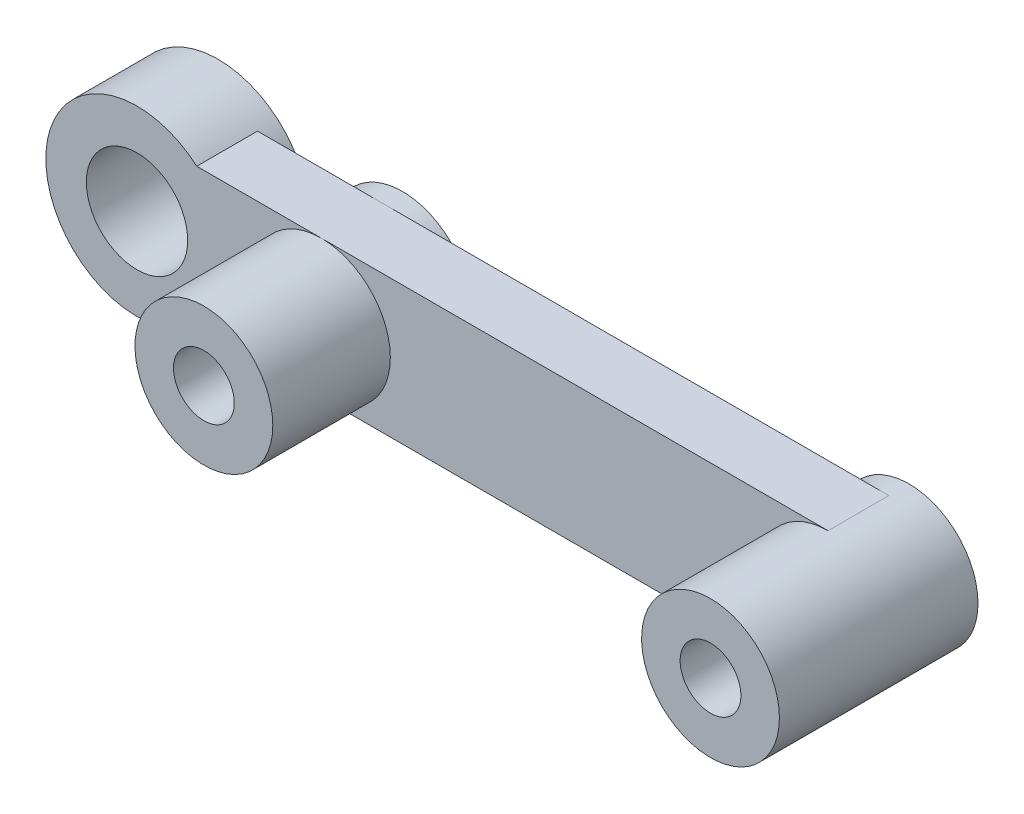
ISO-10303-21;
HEADER;
FILE_DESCRIPTION(('STEP AP214'),'2;1');
FILE_NAME('part.step','',(''),(''),'','','');
FILE_SCHEMA(('AUTOMOTIVE_DESIGN { 1 0 10303 214 1 1 1 1 }'));
ENDSEC;
DATA;
#1=APPLICATION_CONTEXT('core data for automotive mechanical design processes');
#2=APPLICATION_PROTOCOL_DEFINITION('international standard','automotive_design',2000,#1);
#3=PRODUCT_CONTEXT('',#1,'mechanical');
#4=PRODUCT('Part','Part','',(#3));
#5=PRODUCT_RELATED_PRODUCT_CATEGORY('part','',(#4));
#6=PRODUCT_DEFINITION_FORMATION('','',#4);
#7=PRODUCT_DEFINITION_CONTEXT('part definition',#1,'design');
#8=PRODUCT_DEFINITION('design','',#6,#7);
#9=PRODUCT_DEFINITION_SHAPE('','',#8);
#10=(LENGTH_UNIT() NAMED_UNIT(*) SI_UNIT(.MILLI.,.METRE.));
#11=(NAMED_UNIT(*) PLANE_ANGLE_UNIT() SI_UNIT($,.RADIAN.));
#12=(NAMED_UNIT(*) SI_UNIT($,.STERADIAN.) SOLID_ANGLE_UNIT());
#13=UNCERTAINTY_MEASURE_WITH_UNIT(LENGTH_MEASURE(1.E-05),#10,'distance_accuracy_value','');
#14=(GEOMETRIC_REPRESENTATION_CONTEXT(3) GLOBAL_UNCERTAINTY_ASSIGNED_CONTEXT((#13)) GLOBAL_UNIT_ASSIGNED_CONTEXT((#10,
#11,#12)) REPRESENTATION_CONTEXT('',''));
#15=CARTESIAN_POINT('',(0.,0.,0.));
#16=DIRECTION('',(0.,0.,1.));
#17=DIRECTION('',(1.,0.,0.));
#18=AXIS2_PLACEMENT_3D('',#15,#16,#17);
#19=CARTESIAN_POINT('',(-18.1747720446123,0.,0.));
#20=DIRECTION('',(0.,0.,1.));
#21=DIRECTION('',(1.,0.,0.));
#22=AXIS2_PLACEMENT_3D('',#19,#20,#21);
#23=PLANE('',#22);
#24=DIRECTION('',(1.,0.,0.));
#25=VECTOR('',#24,1.);
#26=CARTESIAN_POINT('',(-18.1747720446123,1.,0.));
#27=LINE('',#26,#25);
#28=CARTESIAN_POINT('',(-13.7872898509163,1.,0.));
#29=VERTEX_POINT('',#28);
#30=CARTESIAN_POINT('',(-12.3243874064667,1.,0.));
#31=VERTEX_POINT('',#30);
#32=EDGE_CURVE('E474',#29,#31,#27,.T.);
#33=ORIENTED_EDGE('',*,*,#32,.F.);
#34=CARTESIAN_POINT('',(-18.1747720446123,0.,0.));
#35=DIRECTION('',(0.,0.,1.));
#36=DIRECTION('',(1.,0.,0.));
#37=AXIS2_PLACEMENT_3D('',#34,#35,#36);
#38=CIRCLE('',#37,4.5);
#39=CARTESIAN_POINT('',(-15.2268914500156,3.4,0.));
#40=VERTEX_POINT('',#39);
#41=EDGE_CURVE('E472',#40,#29,#38,.F.);
#42=ORIENTED_EDGE('',*,*,#41,.F.);
#43=DIRECTION('',(-1.,0.,0.));
#44=VECTOR('',#43,1.);
#45=CARTESIAN_POINT('',(-15.2268914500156,3.4,0.));
#46=LINE('',#45,#44);
#47=CARTESIAN_POINT('',(-9.07477204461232,3.4,0.));
#48=VERTEX_POINT('',#47);
#49=EDGE_CURVE('E513',#48,#40,#46,.T.);
#50=ORIENTED_EDGE('',*,*,#49,.F.);
#51=CARTESIAN_POINT('',(-9.07477204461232,0.,0.));
#52=DIRECTION('',(0.,0.,1.));
#53=DIRECTION('',(1.,0.,0.));
#54=AXIS2_PLACEMENT_3D('',#51,#52,#53);
#55=CIRCLE('',#54,3.4);
#56=EDGE_CURVE('E497',#31,#48,#55,.F.);
#57=ORIENTED_EDGE('',*,*,#56,.F.);
#58=EDGE_LOOP('',(#33,#42,#50,#57));
#59=FACE_BOUND('',#58,.T.);
#60=ADVANCED_FACE('F350',(#59),#23,.F.);
#61=DIRECTION('',(1.,0.,0.));
#62=VECTOR('',#61,1.);
#63=CARTESIAN_POINT('',(-18.1747720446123,1.,0.));
#64=LINE('',#63,#62);
#65=CARTESIAN_POINT('',(-5.82515668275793,1.,0.));
#66=VERTEX_POINT('',#65);
#67=CARTESIAN_POINT('',(12.6756125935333,1.,0.));
#68=VERTEX_POINT('',#67);
#69=EDGE_CURVE('E598',#66,#68,#64,.T.);
#70=ORIENTED_EDGE('',*,*,#69,.F.);
#71=EDGE_CURVE('E494',#48,#66,#55,.F.);
#72=ORIENTED_EDGE('',*,*,#71,.F.);
#73=CARTESIAN_POINT('',(15.9252279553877,3.4,0.));
#74=VERTEX_POINT('',#73);
#75=EDGE_CURVE('E514',#74,#48,#46,.T.);
#76=ORIENTED_EDGE('',*,*,#75,.F.);
#77=CARTESIAN_POINT('',(15.9252279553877,0.,0.));
#78=DIRECTION('',(0.,0.,1.));
#79=DIRECTION('',(1.,0.,0.));
#80=AXIS2_PLACEMENT_3D('',#77,#78,#79);
#81=CIRCLE('',#80,3.4);
#82=EDGE_CURVE('E538',#68,#74,#81,.F.);
#83=ORIENTED_EDGE('',*,*,#82,.F.);
#84=EDGE_LOOP('',(#70,#72,#76,#83));
#85=FACE_BOUND('',#84,.T.);
#86=ADVANCED_FACE('F648',(#85),#23,.F.);
#87=CARTESIAN_POINT('',(-9.07477204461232,0.,8.8));
#88=DIRECTION('',(0.,0.,-1.));
#89=DIRECTION('',(-1.,0.,0.));
#90=AXIS2_PLACEMENT_3D('',#87,#88,#89);
#91=CYLINDRICAL_SURFACE('',#90,3.4);
#92=DIRECTION('',(0.,0.,-1.));
#93=VECTOR('',#92,1.);
#94=CARTESIAN_POINT('',(-12.3243874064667,1.,8.8));
#95=LINE('',#94,#93);
#96=CARTESIAN_POINT('',(-12.3243874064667,1.,-1.));
#97=VERTEX_POINT('',#96);
#98=EDGE_CURVE('E458',#31,#97,#95,.T.);
#99=ORIENTED_EDGE('',*,*,#98,.F.);
#100=ORIENTED_EDGE('',*,*,#56,.T.);
#101=ORIENTED_EDGE('',*,*,#71,.T.);
#102=DIRECTION('',(0.,0.,-1.));
#103=VECTOR('',#102,1.);
#104=CARTESIAN_POINT('',(-5.82515668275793,1.,8.8));
#105=LINE('',#104,#103);
#106=CARTESIAN_POINT('',(-5.82515668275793,1.,-1.));
#107=VERTEX_POINT('',#106);
#108=EDGE_CURVE('E582',#107,#66,#105,.F.);
#109=ORIENTED_EDGE('',*,*,#108,.F.);
#110=CARTESIAN_POINT('',(-9.07477204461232,0.,-1.));
#111=DIRECTION('',(0.,0.,1.));
#112=DIRECTION('',(1.,0.,0.));
#113=AXIS2_PLACEMENT_3D('',#110,#111,#112);
#114=CIRCLE('',#113,3.4);
#115=EDGE_CURVE('E488',#107,#97,#114,.T.);
#116=ORIENTED_EDGE('',*,*,#115,.T.);
#117=EDGE_LOOP('',(#99,#100,#101,#109,#116));
#118=FACE_BOUND('',#117,.T.);
#119=ADVANCED_FACE('F642',(#118),#91,.T.);
#120=CARTESIAN_POINT('',(-18.1747720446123,0.,3.));
#121=DIRECTION('',(0.,0.,1.));
#122=DIRECTION('',(1.,0.,0.));
#123=AXIS2_PLACEMENT_3D('',#120,#121,#122);
#124=PLANE('',#123);
#125=CARTESIAN_POINT('',(-18.1747720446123,0.,3.));
#126=DIRECTION('',(0.,0.,1.));
#127=DIRECTION('',(1.,0.,0.));
#128=AXIS2_PLACEMENT_3D('',#125,#126,#127);
#129=CIRCLE('',#128,2.5);
#130=CARTESIAN_POINT('',(-15.6747720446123,0.,3.));
#131=VERTEX_POINT('',#130);
#132=EDGE_CURVE('E572',#131,#131,#129,.T.);
#133=ORIENTED_EDGE('',*,*,#132,.F.);
#134=EDGE_LOOP('',(#133));
#135=FACE_BOUND('',#134,.T.);
#136=CARTESIAN_POINT('',(-18.1747720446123,0.,3.));
#137=DIRECTION('',(0.,0.,1.));
#138=DIRECTION('',(1.,0.,0.));
#139=AXIS2_PLACEMENT_3D('',#136,#137,#138);
#140=CIRCLE('',#139,4.5);
#141=CARTESIAN_POINT('',(-15.2268914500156,3.4,3.));
#142=VERTEX_POINT('',#141);
#143=CARTESIAN_POINT('',(-15.2268914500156,-3.4,3.));
#144=VERTEX_POINT('',#143);
#145=EDGE_CURVE('E517',#142,#144,#140,.T.);
#146=ORIENTED_EDGE('',*,*,#145,.T.);
#147=DIRECTION('',(1.,0.,0.));
#148=VECTOR('',#147,1.);
#149=CARTESIAN_POINT('',(-15.2268914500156,-3.4,3.));
#150=LINE('',#149,#148);
#151=CARTESIAN_POINT('',(-9.07477204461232,-3.4,3.));
#152=VERTEX_POINT('',#151);
#153=EDGE_CURVE('E520',#144,#152,#150,.T.);
#154=ORIENTED_EDGE('',*,*,#153,.T.);
#155=CARTESIAN_POINT('',(-9.07477204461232,0.,3.));
#156=DIRECTION('',(0.,0.,1.));
#157=DIRECTION('',(1.,0.,0.));
#158=AXIS2_PLACEMENT_3D('',#155,#156,#157);
#159=CIRCLE('',#158,3.4);
#160=CARTESIAN_POINT('',(-9.07477204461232,3.4,3.));
#161=VERTEX_POINT('',#160);
#162=EDGE_CURVE('E501',#152,#161,#159,.F.);
#163=ORIENTED_EDGE('',*,*,#162,.T.);
#164=DIRECTION('',(-1.,0.,0.));
#165=VECTOR('',#164,1.);
#166=CARTESIAN_POINT('',(-15.2268914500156,3.4,3.));
#167=LINE('',#166,#165);
#168=EDGE_CURVE('E523',#161,#142,#167,.T.);
#169=ORIENTED_EDGE('',*,*,#168,.T.);
#170=EDGE_LOOP('',(#146,#154,#163,#169));
#171=FACE_BOUND('',#170,.T.);
#172=ADVANCED_FACE('F628',(#135,#171),#124,.T.);
#173=EDGE_CURVE('E499',#161,#152,#159,.F.);
#174=ORIENTED_EDGE('',*,*,#173,.T.);
#175=CARTESIAN_POINT('',(15.9252279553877,-3.4,3.));
#176=VERTEX_POINT('',#175);
#177=EDGE_CURVE('E519',#152,#176,#150,.T.);
#178=ORIENTED_EDGE('',*,*,#177,.T.);
#179=CARTESIAN_POINT('',(15.9252279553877,0.,3.));
#180=DIRECTION('',(0.,0.,1.));
#181=DIRECTION('',(1.,0.,0.));
#182=AXIS2_PLACEMENT_3D('',#179,#180,#181);
#183=CIRCLE('',#182,3.4);
#184=CARTESIAN_POINT('',(15.9252279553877,3.4,3.));
#185=VERTEX_POINT('',#184);
#186=EDGE_CURVE('E507',#176,#185,#183,.F.);
#187=ORIENTED_EDGE('',*,*,#186,.T.);
#188=EDGE_CURVE('E524',#185,#161,#167,.T.);
#189=ORIENTED_EDGE('',*,*,#188,.T.);
#190=EDGE_LOOP('',(#174,#178,#187,#189));
#191=FACE_BOUND('',#190,.T.);
#192=ADVANCED_FACE('F651',(#191),#124,.T.);
#193=CARTESIAN_POINT('',(-13.7872898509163,-1.,0.));
#194=VERTEX_POINT('',#193);
#195=CARTESIAN_POINT('',(-15.2268914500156,-3.4,0.));
#196=VERTEX_POINT('',#195);
#197=EDGE_CURVE('E480',#194,#196,#38,.F.);
#198=ORIENTED_EDGE('',*,*,#197,.F.);
#199=DIRECTION('',(1.,0.,0.));
#200=VECTOR('',#199,1.);
#201=CARTESIAN_POINT('',(-18.1747720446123,-1.,0.));
#202=LINE('',#201,#200);
#203=CARTESIAN_POINT('',(-12.3243874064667,-1.,0.));
#204=VERTEX_POINT('',#203);
#205=EDGE_CURVE('E592',#194,#204,#202,.T.);
#206=ORIENTED_EDGE('',*,*,#205,.T.);
#207=CARTESIAN_POINT('',(-9.07477204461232,-3.4,0.));
#208=VERTEX_POINT('',#207);
#209=EDGE_CURVE('E498',#208,#204,#55,.F.);
#210=ORIENTED_EDGE('',*,*,#209,.F.);
#211=DIRECTION('',(1.,0.,0.));
#212=VECTOR('',#211,1.);
#213=CARTESIAN_POINT('',(-15.2268914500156,-3.4,0.));
#214=LINE('',#213,#212);
#215=EDGE_CURVE('E510',#196,#208,#214,.T.);
#216=ORIENTED_EDGE('',*,*,#215,.F.);
#217=EDGE_LOOP('',(#198,#206,#210,#216));
#218=FACE_BOUND('',#217,.T.);
#219=ADVANCED_FACE('F617',(#218),#23,.F.);
#220=CARTESIAN_POINT('',(-5.82515668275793,-1.,0.));
#221=VERTEX_POINT('',#220);
#222=EDGE_CURVE('E493',#221,#208,#55,.F.);
#223=ORIENTED_EDGE('',*,*,#222,.F.);
#224=DIRECTION('',(1.,0.,0.));
#225=VECTOR('',#224,1.);
#226=CARTESIAN_POINT('',(-18.1747720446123,-1.,0.));
#227=LINE('',#226,#225);
#228=CARTESIAN_POINT('',(12.6756125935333,-1.,0.));
#229=VERTEX_POINT('',#228);
#230=EDGE_CURVE('E373',#221,#229,#227,.T.);
#231=ORIENTED_EDGE('',*,*,#230,.T.);
#232=CARTESIAN_POINT('',(15.9252279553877,-3.4,0.));
#233=VERTEX_POINT('',#232);
#234=EDGE_CURVE('E539',#233,#229,#81,.F.);
#235=ORIENTED_EDGE('',*,*,#234,.F.);
#236=EDGE_CURVE('E509',#208,#233,#214,.T.);
#237=ORIENTED_EDGE('',*,*,#236,.F.);
#238=EDGE_LOOP('',(#223,#231,#235,#237));
#239=FACE_BOUND('',#238,.T.);
#240=ADVANCED_FACE('F652',(#239),#23,.F.);
#241=CARTESIAN_POINT('',(-18.1747720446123,0.,3.));
#242=DIRECTION('',(0.,0.,-1.));
#243=DIRECTION('',(-1.,0.,0.));
#244=AXIS2_PLACEMENT_3D('',#241,#242,#243);
#245=CYLINDRICAL_SURFACE('',#244,4.5);
#246=CARTESIAN_POINT('',(-18.1747720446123,0.,-1.));
#247=DIRECTION('',(0.,0.,-1.));
#248=DIRECTION('',(-1.,0.,0.));
#249=AXIS2_PLACEMENT_3D('',#246,#247,#248);
#250=CIRCLE('',#249,4.5);
#251=CARTESIAN_POINT('',(-13.7872898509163,-1.,-1.));
#252=VERTEX_POINT('',#251);
#253=CARTESIAN_POINT('',(-13.7872898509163,1.,-1.));
#254=VERTEX_POINT('',#253);
#255=EDGE_CURVE('E469',#252,#254,#250,.T.);
#256=ORIENTED_EDGE('',*,*,#255,.F.);
#257=DIRECTION('',(0.,0.,-1.));
#258=VECTOR('',#257,1.);
#259=CARTESIAN_POINT('',(-13.7872898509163,-1.,3.));
#260=LINE('',#259,#258);
#261=EDGE_CURVE('E595',#252,#194,#260,.F.);
#262=ORIENTED_EDGE('',*,*,#261,.T.);
#263=ORIENTED_EDGE('',*,*,#197,.T.);
#264=DIRECTION('',(0.,0.,-1.));
#265=VECTOR('',#264,1.);
#266=CARTESIAN_POINT('',(-15.2268914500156,-3.4,3.));
#267=LINE('',#266,#265);
#268=EDGE_CURVE('E535',#144,#196,#267,.T.);
#269=ORIENTED_EDGE('',*,*,#268,.F.);
#270=ORIENTED_EDGE('',*,*,#145,.F.);
#271=DIRECTION('',(0.,0.,-1.));
#272=VECTOR('',#271,1.);
#273=CARTESIAN_POINT('',(-15.2268914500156,3.4,3.));
#274=LINE('',#273,#272);
#275=EDGE_CURVE('E527',#142,#40,#274,.T.);
#276=ORIENTED_EDGE('',*,*,#275,.T.);
#277=ORIENTED_EDGE('',*,*,#41,.T.);
#278=DIRECTION('',(0.,0.,-1.));
#279=VECTOR('',#278,1.);
#280=CARTESIAN_POINT('',(-13.7872898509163,1.,3.));
#281=LINE('',#280,#279);
#282=EDGE_CURVE('E455',#254,#29,#281,.F.);
#283=ORIENTED_EDGE('',*,*,#282,.F.);
#284=EDGE_LOOP('',(#256,#262,#263,#269,#270,#276,#277,#283));
#285=FACE_BOUND('',#284,.T.);
#286=ADVANCED_FACE('F352',(#285),#245,.T.);
#287=CARTESIAN_POINT('',(-15.2268914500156,-3.4,3.));
#288=DIRECTION('',(0.,1.,0.));
#289=DIRECTION('',(-1.,0.,0.));
#290=AXIS2_PLACEMENT_3D('',#287,#288,#289);
#291=PLANE('',#290);
#292=ORIENTED_EDGE('',*,*,#215,.T.);
#293=ORIENTED_EDGE('',*,*,#236,.T.);
#294=DIRECTION('',(0.,0.,-1.));
#295=VECTOR('',#294,1.);
#296=CARTESIAN_POINT('',(15.9252279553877,-3.4,3.));
#297=LINE('',#296,#295);
#298=EDGE_CURVE('E532',#176,#233,#297,.T.);
#299=ORIENTED_EDGE('',*,*,#298,.F.);
#300=ORIENTED_EDGE('',*,*,#177,.F.);
#301=ORIENTED_EDGE('',*,*,#153,.F.);
#302=ORIENTED_EDGE('',*,*,#268,.T.);
#303=EDGE_LOOP('',(#292,#293,#299,#300,#301,#302));
#304=FACE_BOUND('',#303,.T.);
#305=ADVANCED_FACE('F623',(#304),#291,.F.);
#306=CARTESIAN_POINT('',(15.9252279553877,0.,3.));
#307=DIRECTION('',(0.,0.,-1.));
#308=DIRECTION('',(-1.,0.,0.));
#309=AXIS2_PLACEMENT_3D('',#306,#307,#308);
#310=CYLINDRICAL_SURFACE('',#309,3.4);
#311=DIRECTION('',(0.,0.,-1.));
#312=VECTOR('',#311,1.);
#313=CARTESIAN_POINT('',(15.9252279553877,3.4,3.));
#314=LINE('',#313,#312);
#315=EDGE_CURVE('E529',#185,#74,#314,.T.);
#316=ORIENTED_EDGE('',*,*,#315,.F.);
#317=ORIENTED_EDGE('',*,*,#186,.F.);
#318=ORIENTED_EDGE('',*,*,#298,.T.);
#319=ORIENTED_EDGE('',*,*,#234,.T.);
#320=DIRECTION('',(0.,0.,-1.));
#321=VECTOR('',#320,1.);
#322=CARTESIAN_POINT('',(12.6756125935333,-1.,3.));
#323=LINE('',#322,#321);
#324=CARTESIAN_POINT('',(12.6756125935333,-1.,-1.));
#325=VERTEX_POINT('',#324);
#326=EDGE_CURVE('E483',#229,#325,#323,.T.);
#327=ORIENTED_EDGE('',*,*,#326,.T.);
#328=CARTESIAN_POINT('',(15.9252279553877,0.,-1.));
#329=DIRECTION('',(0.,0.,1.));
#330=DIRECTION('',(1.,0.,0.));
#331=AXIS2_PLACEMENT_3D('',#328,#329,#330);
#332=CIRCLE('',#331,3.4);
#333=CARTESIAN_POINT('',(12.6756125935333,1.,-1.));
#334=VERTEX_POINT('',#333);
#335=EDGE_CURVE('E502',#325,#334,#332,.T.);
#336=ORIENTED_EDGE('',*,*,#335,.T.);
#337=DIRECTION('',(0.,0.,-1.));
#338=VECTOR('',#337,1.);
#339=CARTESIAN_POINT('',(12.6756125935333,1.,3.));
#340=LINE('',#339,#338);
#341=EDGE_CURVE('E365',#68,#334,#340,.T.);
#342=ORIENTED_EDGE('',*,*,#341,.F.);
#343=ORIENTED_EDGE('',*,*,#82,.T.);
#344=EDGE_LOOP('',(#316,#317,#318,#319,#327,#336,#342,#343));
#345=FACE_BOUND('',#344,.T.);
#346=CARTESIAN_POINT('',(15.9252279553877,0.,8.8));
#347=DIRECTION('',(0.,0.,1.));
#348=DIRECTION('',(1.,0.,0.));
#349=AXIS2_PLACEMENT_3D('',#346,#347,#348);
#350=CIRCLE('',#349,3.4);
#351=CARTESIAN_POINT('',(19.3252279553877,0.,8.8));
#352=VERTEX_POINT('',#351);
#353=EDGE_CURVE('E504',#352,#352,#350,.T.);
#354=ORIENTED_EDGE('',*,*,#353,.F.);
#355=EDGE_LOOP('',(#354));
#356=FACE_BOUND('',#355,.T.);
#357=ADVANCED_FACE('F603',(#345,#356),#310,.T.);
#358=CARTESIAN_POINT('',(-15.2268914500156,3.4,3.));
#359=DIRECTION('',(0.,-1.,0.));
#360=DIRECTION('',(1.,0.,0.));
#361=AXIS2_PLACEMENT_3D('',#358,#359,#360);
#362=PLANE('',#361);
#363=ORIENTED_EDGE('',*,*,#75,.T.);
#364=ORIENTED_EDGE('',*,*,#49,.T.);
#365=ORIENTED_EDGE('',*,*,#275,.F.);
#366=ORIENTED_EDGE('',*,*,#168,.F.);
#367=ORIENTED_EDGE('',*,*,#188,.F.);
#368=ORIENTED_EDGE('',*,*,#315,.T.);
#369=EDGE_LOOP('',(#363,#364,#365,#366,#367,#368));
#370=FACE_BOUND('',#369,.T.);
#371=ADVANCED_FACE('F636',(#370),#362,.F.);
#372=CARTESIAN_POINT('',(15.9252279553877,0.,-1.));
#373=DIRECTION('',(0.,0.,1.));
#374=DIRECTION('',(1.,0.,0.));
#375=AXIS2_PLACEMENT_3D('',#372,#373,#374);
#376=PLANE('',#375);
#377=CARTESIAN_POINT('',(-9.07477204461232,0.,-1.));
#378=DIRECTION('',(0.,0.,1.));
#379=DIRECTION('',(1.,0.,0.));
#380=AXIS2_PLACEMENT_3D('',#377,#378,#379);
#381=CIRCLE('',#380,2.9);
#382=CARTESIAN_POINT('',(-6.17477204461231,0.,-1.));
#383=VERTEX_POINT('',#382);
#384=EDGE_CURVE('E358',#383,#383,#381,.T.);
#385=ORIENTED_EDGE('',*,*,#384,.T.);
#386=EDGE_LOOP('',(#385));
#387=FACE_BOUND('',#386,.T.);
#388=CARTESIAN_POINT('',(15.9252279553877,0.,-1.));
#389=DIRECTION('',(0.,0.,1.));
#390=DIRECTION('',(1.,0.,0.));
#391=AXIS2_PLACEMENT_3D('',#388,#389,#390);
#392=CIRCLE('',#391,2.9);
#393=CARTESIAN_POINT('',(13.0252279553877,0.,-1.));
#394=VERTEX_POINT('',#393);
#395=EDGE_CURVE('E544',#394,#394,#392,.T.);
#396=ORIENTED_EDGE('',*,*,#395,.T.);
#397=EDGE_LOOP('',(#396));
#398=FACE_BOUND('',#397,.T.);
#399=CARTESIAN_POINT('',(-18.1747720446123,0.,-1.));
#400=DIRECTION('',(0.,0.,-1.));
#401=DIRECTION('',(-1.,0.,0.));
#402=AXIS2_PLACEMENT_3D('',#399,#400,#401);
#403=CIRCLE('',#402,2.5);
#404=CARTESIAN_POINT('',(-20.6747720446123,0.,-1.));
#405=VERTEX_POINT('',#404);
#406=EDGE_CURVE('E568',#405,#405,#403,.T.);
#407=ORIENTED_EDGE('',*,*,#406,.F.);
#408=EDGE_LOOP('',(#407));
#409=FACE_BOUND('',#408,.T.);
#410=ORIENTED_EDGE('',*,*,#335,.F.);
#411=DIRECTION('',(1.,0.,0.));
#412=VECTOR('',#411,1.);
#413=CARTESIAN_POINT('',(12.5252279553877,-1.,-1.));
#414=LINE('',#413,#412);
#415=CARTESIAN_POINT('',(-5.82515668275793,-1.,-1.));
#416=VERTEX_POINT('',#415);
#417=EDGE_CURVE('E463',#416,#325,#414,.T.);
#418=ORIENTED_EDGE('',*,*,#417,.F.);
#419=CARTESIAN_POINT('',(-12.3243874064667,-1.,-1.));
#420=VERTEX_POINT('',#419);
#421=EDGE_CURVE('E487',#420,#416,#114,.T.);
#422=ORIENTED_EDGE('',*,*,#421,.F.);
#423=DIRECTION('',(1.,0.,0.));
#424=VECTOR('',#423,1.);
#425=CARTESIAN_POINT('',(-13.9239848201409,-1.,-1.));
#426=LINE('',#425,#424);
#427=EDGE_CURVE('E479',#252,#420,#426,.T.);
#428=ORIENTED_EDGE('',*,*,#427,.F.);
#429=ORIENTED_EDGE('',*,*,#255,.T.);
#430=DIRECTION('',(1.,0.,0.));
#431=VECTOR('',#430,1.);
#432=CARTESIAN_POINT('',(-13.9239848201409,1.,-1.));
#433=LINE('',#432,#431);
#434=EDGE_CURVE('E452',#254,#97,#433,.T.);
#435=ORIENTED_EDGE('',*,*,#434,.T.);
#436=ORIENTED_EDGE('',*,*,#115,.F.);
#437=EDGE_CURVE('E464',#107,#334,#433,.T.);
#438=ORIENTED_EDGE('',*,*,#437,.T.);
#439=EDGE_LOOP('',(#410,#418,#422,#428,#429,#435,#436,#438));
#440=FACE_BOUND('',#439,.T.);
#441=ADVANCED_FACE('F477',(#387,#398,#409,#440),#376,.F.);
#442=CARTESIAN_POINT('',(15.9252279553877,0.,8.8));
#443=DIRECTION('',(0.,0.,1.));
#444=DIRECTION('',(1.,0.,0.));
#445=AXIS2_PLACEMENT_3D('',#442,#443,#444);
#446=PLANE('',#445);
#447=CARTESIAN_POINT('',(15.9252279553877,0.,8.8));
#448=DIRECTION('',(0.,0.,-1.));
#449=DIRECTION('',(-1.,0.,0.));
#450=AXIS2_PLACEMENT_3D('',#447,#448,#449);
#451=CIRCLE('',#450,1.5);
#452=CARTESIAN_POINT('',(14.4252279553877,0.,8.8));
#453=VERTEX_POINT('',#452);
#454=EDGE_CURVE('E569',#453,#453,#451,.T.);
#455=ORIENTED_EDGE('',*,*,#454,.T.);
#456=EDGE_LOOP('',(#455));
#457=FACE_BOUND('',#456,.T.);
#458=ORIENTED_EDGE('',*,*,#353,.T.);
#459=EDGE_LOOP('',(#458));
#460=FACE_BOUND('',#459,.T.);
#461=ADVANCED_FACE('F728',(#457,#460),#446,.T.);
#462=ORIENTED_EDGE('',*,*,#209,.T.);
#463=DIRECTION('',(0.,0.,-1.));
#464=VECTOR('',#463,1.);
#465=CARTESIAN_POINT('',(-12.3243874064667,-1.,8.8));
#466=LINE('',#465,#464);
#467=EDGE_CURVE('E589',#204,#420,#466,.T.);
#468=ORIENTED_EDGE('',*,*,#467,.T.);
#469=ORIENTED_EDGE('',*,*,#421,.T.);
#470=DIRECTION('',(0.,0.,-1.));
#471=VECTOR('',#470,1.);
#472=CARTESIAN_POINT('',(-5.82515668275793,-1.,8.8));
#473=LINE('',#472,#471);
#474=EDGE_CURVE('E473',#416,#221,#473,.F.);
#475=ORIENTED_EDGE('',*,*,#474,.T.);
#476=ORIENTED_EDGE('',*,*,#222,.T.);
#477=EDGE_LOOP('',(#462,#468,#469,#475,#476));
#478=FACE_BOUND('',#477,.T.);
#479=ADVANCED_FACE('F611',(#478),#91,.T.);
#480=ORIENTED_EDGE('',*,*,#173,.F.);
#481=ORIENTED_EDGE('',*,*,#162,.F.);
#482=EDGE_LOOP('',(#480,#481));
#483=FACE_BOUND('',#482,.T.);
#484=CARTESIAN_POINT('',(-9.07477204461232,0.,8.8));
#485=DIRECTION('',(0.,0.,1.));
#486=DIRECTION('',(1.,0.,0.));
#487=AXIS2_PLACEMENT_3D('',#484,#485,#486);
#488=CIRCLE('',#487,3.4);
#489=CARTESIAN_POINT('',(-5.67477204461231,0.,8.8));
#490=VERTEX_POINT('',#489);
#491=EDGE_CURVE('E490',#490,#490,#488,.T.);
#492=ORIENTED_EDGE('',*,*,#491,.F.);
#493=EDGE_LOOP('',(#492));
#494=FACE_BOUND('',#493,.T.);
#495=ADVANCED_FACE('F677',(#483,#494),#91,.T.);
#496=CARTESIAN_POINT('',(-9.07477204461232,0.,8.8));
#497=DIRECTION('',(0.,0.,1.));
#498=DIRECTION('',(1.,0.,0.));
#499=AXIS2_PLACEMENT_3D('',#496,#497,#498);
#500=PLANE('',#499);
#501=CARTESIAN_POINT('',(-9.07477204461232,0.,8.8));
#502=DIRECTION('',(0.,0.,-1.));
#503=DIRECTION('',(-1.,0.,0.));
#504=AXIS2_PLACEMENT_3D('',#501,#502,#503);
#505=CIRCLE('',#504,1.5);
#506=CARTESIAN_POINT('',(-10.5747720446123,0.,8.8));
#507=VERTEX_POINT('',#506);
#508=EDGE_CURVE('E566',#507,#507,#505,.T.);
#509=ORIENTED_EDGE('',*,*,#508,.T.);
#510=EDGE_LOOP('',(#509));
#511=FACE_BOUND('',#510,.T.);
#512=ORIENTED_EDGE('',*,*,#491,.T.);
#513=EDGE_LOOP('',(#512));
#514=FACE_BOUND('',#513,.T.);
#515=ADVANCED_FACE('F748',(#511,#514),#500,.T.);
#516=CARTESIAN_POINT('',(-13.9239848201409,-1.,-1.));
#517=DIRECTION('',(0.,-1.,0.));
#518=DIRECTION('',(0.,0.,-1.));
#519=AXIS2_PLACEMENT_3D('',#516,#517,#518);
#520=PLANE('',#519);
#521=ORIENTED_EDGE('',*,*,#261,.F.);
#522=ORIENTED_EDGE('',*,*,#427,.T.);
#523=ORIENTED_EDGE('',*,*,#467,.F.);
#524=ORIENTED_EDGE('',*,*,#205,.F.);
#525=EDGE_LOOP('',(#521,#522,#523,#524));
#526=FACE_BOUND('',#525,.T.);
#527=ADVANCED_FACE('F614',(#526),#520,.T.);
#528=CARTESIAN_POINT('',(-13.9239848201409,1.,-1.));
#529=DIRECTION('',(0.,-1.,0.));
#530=DIRECTION('',(0.,0.,-1.));
#531=AXIS2_PLACEMENT_3D('',#528,#529,#530);
#532=PLANE('',#531);
#533=ORIENTED_EDGE('',*,*,#434,.F.);
#534=ORIENTED_EDGE('',*,*,#282,.T.);
#535=ORIENTED_EDGE('',*,*,#32,.T.);
#536=ORIENTED_EDGE('',*,*,#98,.T.);
#537=EDGE_LOOP('',(#533,#534,#535,#536));
#538=FACE_BOUND('',#537,.T.);
#539=ADVANCED_FACE('F454',(#538),#532,.F.);
#540=CARTESIAN_POINT('',(12.5252279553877,-1.,-1.));
#541=DIRECTION('',(0.,-1.,0.));
#542=DIRECTION('',(0.,0.,-1.));
#543=AXIS2_PLACEMENT_3D('',#540,#541,#542);
#544=PLANE('',#543);
#545=ORIENTED_EDGE('',*,*,#230,.F.);
#546=ORIENTED_EDGE('',*,*,#474,.F.);
#547=ORIENTED_EDGE('',*,*,#417,.T.);
#548=ORIENTED_EDGE('',*,*,#326,.F.);
#549=EDGE_LOOP('',(#545,#546,#547,#548));
#550=FACE_BOUND('',#549,.T.);
#551=ADVANCED_FACE('F607',(#550),#544,.T.);
#552=CARTESIAN_POINT('',(12.5252279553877,1.,-1.));
#553=DIRECTION('',(0.,-1.,0.));
#554=DIRECTION('',(0.,0.,-1.));
#555=AXIS2_PLACEMENT_3D('',#552,#553,#554);
#556=PLANE('',#555);
#557=ORIENTED_EDGE('',*,*,#341,.T.);
#558=ORIENTED_EDGE('',*,*,#437,.F.);
#559=ORIENTED_EDGE('',*,*,#108,.T.);
#560=ORIENTED_EDGE('',*,*,#69,.T.);
#561=EDGE_LOOP('',(#557,#558,#559,#560));
#562=FACE_BOUND('',#561,.T.);
#563=ADVANCED_FACE('F646',(#562),#556,.F.);
#564=CARTESIAN_POINT('',(-18.1747720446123,0.,8.8));
#565=DIRECTION('',(0.,0.,-1.));
#566=DIRECTION('',(-1.,0.,0.));
#567=AXIS2_PLACEMENT_3D('',#564,#565,#566);
#568=CYLINDRICAL_SURFACE('',#567,2.5);
#569=ORIENTED_EDGE('',*,*,#132,.T.);
#570=EDGE_LOOP('',(#569));
#571=FACE_BOUND('',#570,.T.);
#572=ORIENTED_EDGE('',*,*,#406,.T.);
#573=EDGE_LOOP('',(#572));
#574=FACE_BOUND('',#573,.T.);
#575=ADVANCED_FACE('F562',(#571,#574),#568,.F.);
#576=CARTESIAN_POINT('',(-9.07477204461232,0.,8.8));
#577=DIRECTION('',(0.,0.,-1.));
#578=DIRECTION('',(-1.,0.,0.));
#579=AXIS2_PLACEMENT_3D('',#576,#577,#578);
#580=CYLINDRICAL_SURFACE('',#579,1.5);
#581=CARTESIAN_POINT('',(-9.07477204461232,0.,0.400000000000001));
#582=DIRECTION('',(0.,0.,1.));
#583=DIRECTION('',(1.,0.,0.));
#584=AXIS2_PLACEMENT_3D('',#581,#582,#583);
#585=CIRCLE('',#584,1.5);
#586=CARTESIAN_POINT('',(-7.57477204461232,0.,0.400000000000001));
#587=VERTEX_POINT('',#586);
#588=EDGE_CURVE('E541',#587,#587,#585,.F.);
#589=ORIENTED_EDGE('',*,*,#588,.T.);
#590=EDGE_LOOP('',(#589));
#591=FACE_BOUND('',#590,.T.);
#592=ORIENTED_EDGE('',*,*,#508,.F.);
#593=EDGE_LOOP('',(#592));
#594=FACE_BOUND('',#593,.T.);
#595=ADVANCED_FACE('F559',(#591,#594),#580,.F.);
#596=CARTESIAN_POINT('',(15.9252279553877,0.,8.8));
#597=DIRECTION('',(0.,0.,-1.));
#598=DIRECTION('',(-1.,0.,0.));
#599=AXIS2_PLACEMENT_3D('',#596,#597,#598);
#600=CYLINDRICAL_SURFACE('',#599,1.5);
#601=CARTESIAN_POINT('',(15.9252279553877,0.,0.399999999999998));
#602=DIRECTION('',(0.,0.,1.));
#603=DIRECTION('',(1.,0.,0.));
#604=AXIS2_PLACEMENT_3D('',#601,#602,#603);
#605=CIRCLE('',#604,1.5);
#606=CARTESIAN_POINT('',(14.4252279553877,0.,0.399999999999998));
#607=VERTEX_POINT('',#606);
#608=EDGE_CURVE('E11',#607,#607,#605,.F.);
#609=ORIENTED_EDGE('',*,*,#608,.T.);
#610=EDGE_LOOP('',(#609));
#611=FACE_BOUND('',#610,.T.);
#612=ORIENTED_EDGE('',*,*,#454,.F.);
#613=EDGE_LOOP('',(#612));
#614=FACE_BOUND('',#613,.T.);
#615=ADVANCED_FACE('F555',(#611,#614),#600,.F.);
#616=CARTESIAN_POINT('',(-9.07477204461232,0.,0.400000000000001));
#617=DIRECTION('',(0.,0.,-1.));
#618=DIRECTION('',(-1.,0.,0.));
#619=AXIS2_PLACEMENT_3D('',#616,#617,#618);
#620=CONICAL_SURFACE('',#619,1.5,0.78539816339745);
#621=ORIENTED_EDGE('',*,*,#384,.F.);
#622=EDGE_LOOP('',(#621));
#623=FACE_BOUND('',#622,.T.);
#624=ORIENTED_EDGE('',*,*,#588,.F.);
#625=EDGE_LOOP('',(#624));
#626=FACE_BOUND('',#625,.T.);
#627=ADVANCED_FACE('F551',(#623,#626),#620,.F.);
#628=CARTESIAN_POINT('',(15.9252279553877,0.,0.399999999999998));
#629=DIRECTION('',(0.,0.,-1.));
#630=DIRECTION('',(-1.,0.,0.));
#631=AXIS2_PLACEMENT_3D('',#628,#629,#630);
#632=CONICAL_SURFACE('',#631,1.5,0.78539816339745);
#633=CARTESIAN_POINT('',(13.0252279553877,0.,-1.));
#634=CARTESIAN_POINT('',(13.039811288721,0.,-0.985416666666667));
#635=CARTESIAN_POINT('',(13.0543946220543,0.,-0.970833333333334));
#636=CARTESIAN_POINT('',(13.083561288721,0.,-0.941666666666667));
#637=CARTESIAN_POINT('',(13.0981446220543,0.,-0.927083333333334));
#638=CARTESIAN_POINT('',(13.127311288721,0.,-0.897916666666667));
#639=CARTESIAN_POINT('',(13.1418946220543,0.,-0.883333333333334));
#640=CARTESIAN_POINT('',(13.171061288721,0.,-0.854166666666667));
#641=CARTESIAN_POINT('',(13.1856446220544,0.,-0.839583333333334));
#642=CARTESIAN_POINT('',(13.214811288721,0.,-0.810416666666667));
#643=CARTESIAN_POINT('',(13.2293946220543,0.,-0.795833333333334));
#644=CARTESIAN_POINT('',(13.258561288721,0.,-0.766666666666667));
#645=CARTESIAN_POINT('',(13.2731446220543,0.,-0.752083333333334));
#646=CARTESIAN_POINT('',(13.302311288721,0.,-0.722916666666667));
#647=CARTESIAN_POINT('',(13.3168946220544,0.,-0.708333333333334));
#648=CARTESIAN_POINT('',(13.346061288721,0.,-0.679166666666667));
#649=CARTESIAN_POINT('',(13.3606446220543,0.,-0.664583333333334));
#650=CARTESIAN_POINT('',(13.389811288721,0.,-0.635416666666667));
#651=CARTESIAN_POINT('',(13.4043946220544,0.,-0.620833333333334));
#652=CARTESIAN_POINT('',(13.433561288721,0.,-0.591666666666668));
#653=CARTESIAN_POINT('',(13.4481446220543,0.,-0.577083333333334));
#654=CARTESIAN_POINT('',(13.477311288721,0.,-0.547916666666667));
#655=CARTESIAN_POINT('',(13.4918946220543,0.,-0.533333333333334));
#656=CARTESIAN_POINT('',(13.521061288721,0.,-0.504166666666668));
#657=CARTESIAN_POINT('',(13.5356446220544,0.,-0.489583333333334));
#658=CARTESIAN_POINT('',(13.564811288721,0.,-0.460416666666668));
#659=CARTESIAN_POINT('',(13.5793946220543,0.,-0.445833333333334));
#660=CARTESIAN_POINT('',(13.608561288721,0.,-0.416666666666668));
#661=CARTESIAN_POINT('',(13.6231446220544,0.,-0.402083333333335));
#662=CARTESIAN_POINT('',(13.652311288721,0.,-0.372916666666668));
#663=CARTESIAN_POINT('',(13.6668946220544,0.,-0.358333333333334));
#664=CARTESIAN_POINT('',(13.696061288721,0.,-0.329166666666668));
#665=CARTESIAN_POINT('',(13.7106446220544,0.,-0.314583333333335));
#666=CARTESIAN_POINT('',(13.739811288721,0.,-0.285416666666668));
#667=CARTESIAN_POINT('',(13.7543946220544,0.,-0.270833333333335));
#668=CARTESIAN_POINT('',(13.783561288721,0.,-0.241666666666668));
#669=CARTESIAN_POINT('',(13.7981446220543,0.,-0.227083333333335));
#670=CARTESIAN_POINT('',(13.827311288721,0.,-0.197916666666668));
#671=CARTESIAN_POINT('',(13.8418946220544,0.,-0.183333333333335));
#672=CARTESIAN_POINT('',(13.871061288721,0.,-0.154166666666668));
#673=CARTESIAN_POINT('',(13.8856446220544,0.,-0.139583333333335));
#674=CARTESIAN_POINT('',(13.914811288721,0.,-0.110416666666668));
#675=CARTESIAN_POINT('',(13.9293946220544,0.,-0.0958333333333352));
#676=CARTESIAN_POINT('',(13.958561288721,0.,-0.0666666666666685));
#677=CARTESIAN_POINT('',(13.9731446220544,0.,-0.052083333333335));
#678=CARTESIAN_POINT('',(14.002311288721,0.,-0.0229166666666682));
#679=CARTESIAN_POINT('',(14.0168946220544,0.,-0.00833333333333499));
#680=CARTESIAN_POINT('',(14.046061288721,0.,0.0208333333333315));
#681=CARTESIAN_POINT('',(14.0606446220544,0.,0.0354166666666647));
#682=CARTESIAN_POINT('',(14.089811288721,0.,0.0645833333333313));
#683=CARTESIAN_POINT('',(14.1043946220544,0.,0.0791666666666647));
#684=CARTESIAN_POINT('',(14.133561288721,0.,0.108333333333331));
#685=CARTESIAN_POINT('',(14.1481446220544,0.,0.122916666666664));
#686=CARTESIAN_POINT('',(14.177311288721,0.,0.152083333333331));
#687=CARTESIAN_POINT('',(14.1918946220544,0.,0.166666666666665));
#688=CARTESIAN_POINT('',(14.221061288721,0.,0.195833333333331));
#689=CARTESIAN_POINT('',(14.2356446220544,0.,0.210416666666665));
#690=CARTESIAN_POINT('',(14.264811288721,0.,0.239583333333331));
#691=CARTESIAN_POINT('',(14.2793946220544,0.,0.254166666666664));
#692=CARTESIAN_POINT('',(14.308561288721,0.,0.283333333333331));
#693=CARTESIAN_POINT('',(14.3231446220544,0.,0.297916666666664));
#694=CARTESIAN_POINT('',(14.352311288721,0.,0.327083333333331));
#695=CARTESIAN_POINT('',(14.3668946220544,0.,0.341666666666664));
#696=CARTESIAN_POINT('',(14.396061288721,0.,0.370833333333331));
#697=CARTESIAN_POINT('',(14.4106446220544,0.,0.385416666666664));
#698=CARTESIAN_POINT('',(14.4252279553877,0.,0.399999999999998));
#699=B_SPLINE_CURVE_WITH_KNOTS('',3,(#633,#634,#635,#636,#637,#638,#639,#640,#641,#642,#643,
#644,#645,#646,#647,#648,#649,#650,#651,#652,#653,#654,#655,#656,#657,#658,#659,#660,#661,#662,
#663,#664,#665,#666,#667,#668,#669,#670,#671,#672,#673,#674,#675,#676,#677,#678,#679,#680,#681,
#682,#683,#684,#685,#686,#687,#688,#689,#690,#691,#692,#693,#694,#695,#696,#697,#698),
.UNSPECIFIED.,.F.,.F.,(4,2,2,2,2,2,2,2,2,2,2,2,2,2,2,2,2,2,2,2,2,2,2,2,2,2,2,2,2,2,2,2,4),(0.,
0.0618718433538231,0.123743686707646,0.185615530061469,0.247487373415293,0.309359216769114,
0.371231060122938,0.433102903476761,0.494974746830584,0.556846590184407,0.618718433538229,
0.680590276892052,0.742462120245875,0.804333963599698,0.866205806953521,0.928077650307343,
0.989949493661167,1.05182133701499,1.11369318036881,1.17556502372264,1.23743686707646,
1.29930871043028,1.3611805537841,1.42305239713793,1.48492424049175,1.54679608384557,
1.6086679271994,1.67053977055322,1.73241161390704,1.79428345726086,1.85615530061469,
1.91802714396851,1.97989898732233),.UNSPECIFIED.);
#700=EDGE_CURVE('BSEAM554',#394,#607,#699,.T.);
#701=ORIENTED_EDGE('',*,*,#395,.F.);
#702=ORIENTED_EDGE('',*,*,#608,.F.);
#703=ORIENTED_EDGE('',*,*,#700,.T.);
#704=ORIENTED_EDGE('',*,*,#700,.F.);
#705=EDGE_LOOP('',(#701,#703,#702,#704));
#706=FACE_BOUND('',#705,.T.);
#707=ADVANCED_FACE('F554',(#706),#632,.F.);
#708=CLOSED_SHELL('',(#60,#86,#119,#172,#192,#219,#240,#286,#305,#357,#371,#441,#461,#479,#495,
#515,#527,#539,#551,#563,#575,#595,#615,#627,#707));
#709=MANIFOLD_SOLID_BREP('B2',#708);
#710=ADVANCED_BREP_SHAPE_REPRESENTATION('',(#18,#709),#14);
#711=SHAPE_DEFINITION_REPRESENTATION(#9,#710);
ENDSEC;
END-ISO-10303-21;
